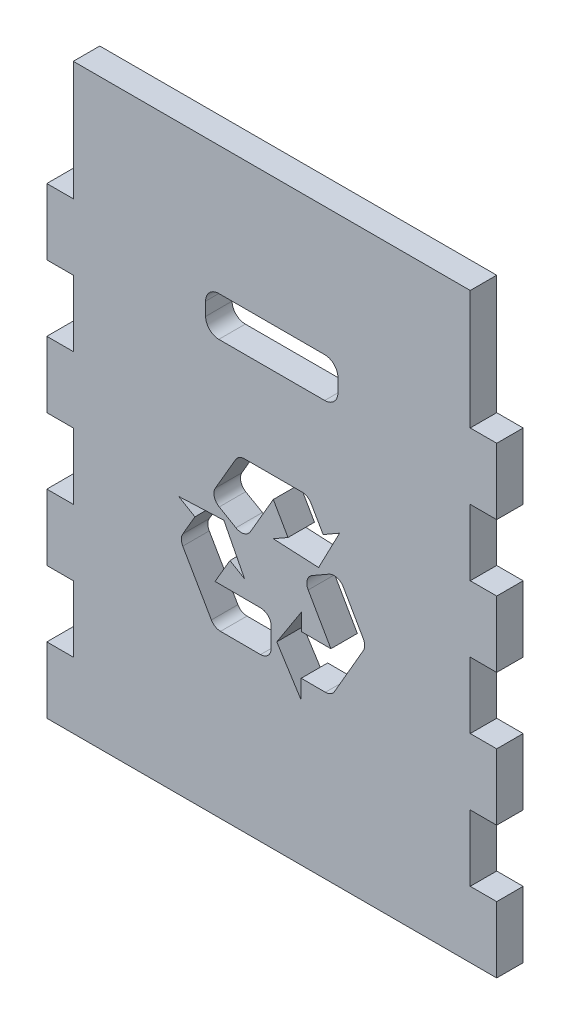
from build123d import *

# Parameters (mm, degrees)
EXTRUDE1_DEPTH = 20
EXTRUDE2_DEPTH = 597.741149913
EXTRUDE3_DEPTH = 597.741149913


with BuildPart() as part:
    # Sketch1 → Extrude1 (new body)
    with BuildSketch(Plane.XY):
        Polygon((0, 50), (20, 50), (320, 50), (340, 50), (340, 100), (320, 100), (320, 150), (340, 150), (340, 200), (320, 200), (320, 250), (340, 250), (340, 300), (320, 300), (320, 350), (340, 350), (340, 400), (320, 400), (320, 490), (20, 490), (20, 400), (0, 400), (0, 350), (20, 350), (20, 300), (0, 300), (0, 250), (20, 250), (20, 200), (0, 200), (0, 150), (20, 150), (20, 100), (0, 100), align=None)
    extrude(amount=EXTRUDE1_DEPTH)

    # Sketch2 → Extrude2 (cut, through all)
    with BuildSketch(Plane.XY.offset(20)):
        with BuildLine():
            Line((130, 393), (210, 393))
            ThreePointArc((210, 393), (217.071067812, 390.071067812), (220, 383))
            Line((220, 383), (220, 373))
            ThreePointArc((220, 373), (217.071067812, 365.928932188), (210, 363))
            Line((210, 363), (130, 363))
            ThreePointArc((130, 363), (122.928932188, 365.928932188), (120, 373))
            Line((120, 373), (120, 383))
            ThreePointArc((120, 383), (122.928932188, 390.071067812), (130, 393))
        make_face()
    extrude(amount=-EXTRUDE2_DEPTH, mode=Mode.SUBTRACT)

    # Sketch3 → Extrude3 (cut, through all)
    with BuildSketch(Plane.XY.offset(20)):
        with BuildLine():
            Line((149.513054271, 294.498642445), (192.790434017, 294.498642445))
            ThreePointArc((192.790434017, 294.498642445), (196.802037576, 293.420133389), (199.732003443, 290.475401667))
            Line((199.732003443, 290.475401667), (208.804949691, 274.638263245))
            Line((208.804949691, 274.638263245), (221.249681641, 281.767732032))
            Line((221.249681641, 281.767732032), (205.398010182, 251.351202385))
            Line((205.398010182, 251.351202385), (171.141378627, 253.061160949))
            Line((171.141378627, 253.061160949), (182.261408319, 259.43172039))
            Line((182.261408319, 259.43172039), (171.167798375, 278.795996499))
            Line((171.167798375, 278.795996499), (153.833388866, 249.002948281))
            ThreePointArc((153.833388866, 249.002948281), (148.96327371, 245.291841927), (142.895433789, 246.11138491))
            Line((142.895433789, 246.11138491), (130.283929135, 253.449102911))
            ThreePointArc((130.283929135, 253.449102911), (126.57282278, 258.319218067), (127.392365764, 264.387057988))
            Line((127.392365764, 264.387057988), (142.598295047, 290.521838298))
            ThreePointArc((142.598295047, 290.521838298), (145.52466906, 293.433538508), (149.513054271, 294.498642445))
        make_face()
        with BuildLine():
            Line((173.796804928, 186.922471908), (192.405988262, 215.734605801))
            Line((192.405988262, 215.734605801), (192.363039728, 202.919097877))
            Line((192.363039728, 202.919097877), (214.679799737, 202.844307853))
            Line((214.679799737, 202.844307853), (197.545467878, 232.752870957))
            ThreePointArc((197.545467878, 232.752870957), (196.766613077, 238.826067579), (200.510278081, 243.671199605))
            Line((200.510278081, 243.671199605), (213.170680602, 250.924224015))
            ThreePointArc((213.170680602, 250.924224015), (219.243877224, 251.703078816), (224.08900925, 247.959413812))
            Line((224.08900925, 247.959413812), (239.119428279, 221.72330261))
            ThreePointArc((239.119428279, 221.72330261), (240.177847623, 217.733138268), (239.106062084, 213.746543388))
            Line((239.106062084, 213.746543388), (217.467372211, 176.267233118))
            ThreePointArc((217.467372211, 176.267233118), (214.527554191, 173.332337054), (210.512358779, 172.267278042))
            Line((210.512358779, 172.267278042), (192.260521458, 172.328445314))
            Line((192.260521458, 172.328445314), (192.212456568, 157.986256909))
            Line((192.212456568, 157.986256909), (173.796804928, 186.922471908))
        make_face()
        with BuildLine():
            Line((133.800490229, 246.504283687), (149.44793845, 215.98219123))
            Line((149.44793845, 215.98219123), (138.370857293, 222.427139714))
            Line((138.370857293, 222.427139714), (127.147707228, 203.137653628))
            Line((127.147707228, 203.137653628), (161.616448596, 203.022138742))
            ThreePointArc((161.616448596, 203.022138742), (167.265418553, 200.660048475), (169.58959347, 194.995373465))
            Line((169.58959347, 194.995373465), (169.540695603, 180.404631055))
            ThreePointArc((169.540695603, 180.404631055), (167.178605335, 174.755661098), (161.513930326, 172.43148618))
            Line((161.513930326, 172.43148618), (131.277582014, 172.532817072))
            ThreePointArc((131.277582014, 172.532817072), (127.292788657, 173.611281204), (124.376188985, 176.532772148))
            Line((124.376188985, 176.532772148), (102.737499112, 214.012082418))
            ThreePointArc((102.737499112, 214.012082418), (101.665713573, 218.025487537), (102.750943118, 222.035278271))
            Line((102.750943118, 222.035278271), (111.929834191, 237.811249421))
            Line((111.929834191, 237.811249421), (99.53316713, 245.023969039))
            Line((99.53316713, 245.023969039), (133.800490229, 246.504283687))
        make_face()
    extrude(amount=-EXTRUDE3_DEPTH, mode=Mode.SUBTRACT)


solid = part.part
